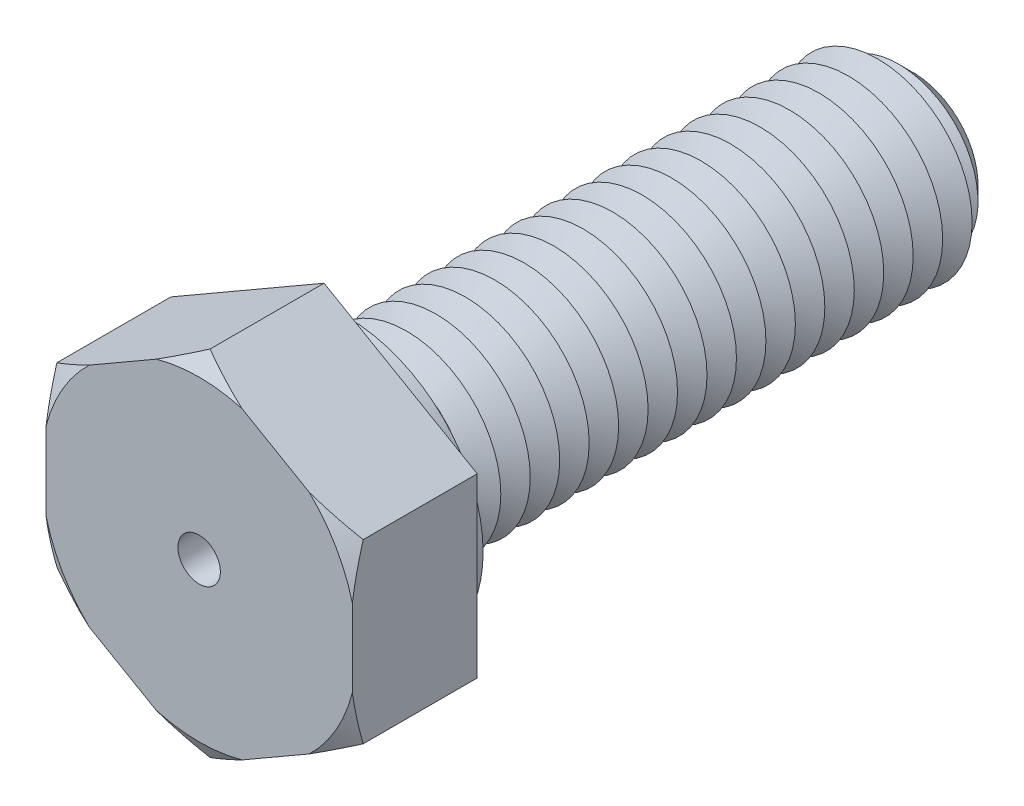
from build123d import *

# Parameters (mm, degrees)
BOSS_EXTRUDE1_DEPTH = 5.3
SKETCH3_R           = 4
BOSS_EXTRUDE2_DEPTH = 25
SKETCH4_R           = 5.75
BOSS_EXTRUDE3_DEPTH = 1
CHAMFER1_SIZE       = 1.25
LPATTERN1_COUNT     = 19
LPATTERN1_PITCH     = 1.25
SKETCH8_R           = 0.9
CUT_EXTRUDE1_DEPTH  = 30.3


with BuildPart() as part:
    # Sketch2 → Boss-Extrude1 (new body)
    with BuildSketch(Plane.XY):
        Polygon((0, 7.505553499), (-6.5, 3.75277675), (-6.5, -3.75277675), (0, -7.505553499), (6.5, -3.75277675), (6.5, 3.75277675), align=None)
    extrude(amount=BOSS_EXTRUDE1_DEPTH)

    # Sketch3 → Boss-Extrude2 (add)
    with BuildSketch(Plane(origin=(0, 0, 0), x_dir=(-1, 0, 0), z_dir=(0, 0, -1))):
        Circle(SKETCH3_R)
    extrude(amount=BOSS_EXTRUDE2_DEPTH)

    # Sketch4 → Boss-Extrude3 (add)
    with BuildSketch(Plane(origin=(0, 0, 0), x_dir=(-1, 0, 0), z_dir=(0, 0, -1))):
        with Locations(Location((0, 0, 0), (0, 0, 180))):
            Circle(SKETCH4_R)
    extrude(amount=BOSS_EXTRUDE3_DEPTH)

    # Chamfer1
    chamfer1_edges = [part.edges().sort_by_distance(p)[0] for p in [
        (4, 0, -25),
    ]]
    chamfer(chamfer1_edges, length=CHAMFER1_SIZE)

    # Sketch6 → Cut-Revolve1 (revolve, cut)
    with BuildSketch(Plane(origin=(0, 0, 0), x_dir=(0, 0, -1), z_dir=(1, 0, 0)), mode=Mode.PRIVATE) as cut_revolve1_sk:
        Polygon((1, 4), (1.625, 2.917468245), (2.25, 4), align=None)
    cut_revolve1 = revolve(cut_revolve1_sk.sketch.rotate(Axis((0, 0, 3.211670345), (0, 0, -1)), 90), axis=Axis((0, 0, 3.211670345), (0, 0, -1)), mode=Mode.SUBTRACT)

    # LPattern1: Cut-Revolve1 ×19
    with Locations(*[(0, 0, -i * LPATTERN1_PITCH) for i in range(1, LPATTERN1_COUNT)]):
        add(cut_revolve1, mode=Mode.SUBTRACT)

    # Sketch7 → Cut-Revolve2 (revolve, cut)
    with BuildSketch(Plane(origin=(0, 0, 0), x_dir=(0, 0, -1), z_dir=(1, 0, 0)), mode=Mode.PRIVATE) as cut_revolve2_sk:
        Polygon((-5.3, 7.505553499), (-5.3, 6.705553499), (-4.838119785, 7.505553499), align=None)
    revolve(cut_revolve2_sk.sketch.rotate(Axis((0, 0, 3.211670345), (0, 0, -1)), 270), axis=Axis((0, 0, 3.211670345), (0, 0, -1)), mode=Mode.SUBTRACT)

    # Sketch8 → Cut-Extrude1 (cut)
    with BuildSketch(Plane.XY.offset(5.3)):
        Circle(SKETCH8_R)
    extrude(amount=-CUT_EXTRUDE1_DEPTH, mode=Mode.SUBTRACT)


solid = part.part
